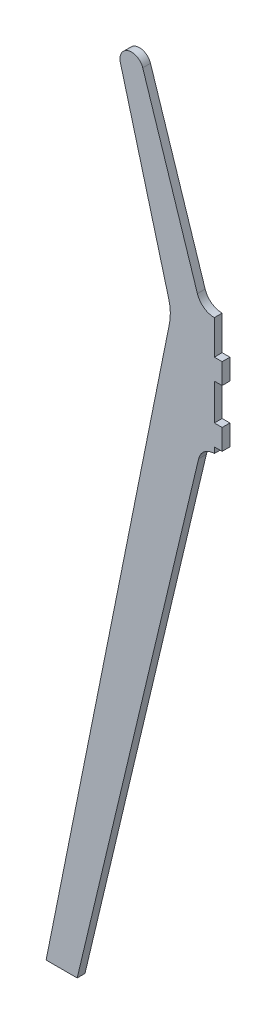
ISO-10303-21;
HEADER;
FILE_DESCRIPTION(('STEP AP214'),'2;1');
FILE_NAME('part.step','',(''),(''),'','','');
FILE_SCHEMA(('AUTOMOTIVE_DESIGN { 1 0 10303 214 1 1 1 1 }'));
ENDSEC;
DATA;
#1=APPLICATION_CONTEXT('core data for automotive mechanical design processes');
#2=APPLICATION_PROTOCOL_DEFINITION('international standard','automotive_design',2000,#1);
#3=PRODUCT_CONTEXT('',#1,'mechanical');
#4=PRODUCT('Part','Part','',(#3));
#5=PRODUCT_RELATED_PRODUCT_CATEGORY('part','',(#4));
#6=PRODUCT_DEFINITION_FORMATION('','',#4);
#7=PRODUCT_DEFINITION_CONTEXT('part definition',#1,'design');
#8=PRODUCT_DEFINITION('design','',#6,#7);
#9=PRODUCT_DEFINITION_SHAPE('','',#8);
#10=(LENGTH_UNIT() NAMED_UNIT(*) SI_UNIT(.MILLI.,.METRE.));
#11=(NAMED_UNIT(*) PLANE_ANGLE_UNIT() SI_UNIT($,.RADIAN.));
#12=(NAMED_UNIT(*) SI_UNIT($,.STERADIAN.) SOLID_ANGLE_UNIT());
#13=UNCERTAINTY_MEASURE_WITH_UNIT(LENGTH_MEASURE(1.E-05),#10,'distance_accuracy_value','');
#14=(GEOMETRIC_REPRESENTATION_CONTEXT(3) GLOBAL_UNCERTAINTY_ASSIGNED_CONTEXT((#13)) GLOBAL_UNIT_ASSIGNED_CONTEXT((#10,
#11,#12)) REPRESENTATION_CONTEXT('',''));
#15=CARTESIAN_POINT('',(0.,0.,0.));
#16=DIRECTION('',(0.,0.,1.));
#17=DIRECTION('',(1.,0.,0.));
#18=AXIS2_PLACEMENT_3D('',#15,#16,#17);
#19=CARTESIAN_POINT('',(-332.179186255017,-1195.84507051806,7.5));
#20=DIRECTION('',(0.980338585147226,-0.197322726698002,0.));
#21=DIRECTION('',(0.197322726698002,0.980338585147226,0.));
#22=AXIS2_PLACEMENT_3D('',#19,#20,#21);
#23=PLANE('',#22);
#24=DIRECTION('',(-0.197322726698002,-0.980338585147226,0.));
#25=VECTOR('',#24,1.);
#26=CARTESIAN_POINT('',(-332.179186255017,-1195.84507051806,-7.5));
#27=LINE('',#26,#25);
#28=CARTESIAN_POINT('',(-94.2175143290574,-13.604115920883,-7.5));
#29=VERTEX_POINT('',#28);
#30=CARTESIAN_POINT('',(-332.179186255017,-1195.84507051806,-7.5));
#31=VERTEX_POINT('',#30);
#32=EDGE_CURVE('E204',#29,#31,#27,.T.);
#33=ORIENTED_EDGE('',*,*,#32,.T.);
#34=DIRECTION('',(0.,0.,-1.));
#35=VECTOR('',#34,1.);
#36=CARTESIAN_POINT('',(-332.179186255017,-1195.84507051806,7.5));
#37=LINE('',#36,#35);
#38=CARTESIAN_POINT('',(-332.179186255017,-1195.84507051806,7.5));
#39=VERTEX_POINT('',#38);
#40=EDGE_CURVE('E11',#39,#31,#37,.T.);
#41=ORIENTED_EDGE('',*,*,#40,.F.);
#42=DIRECTION('',(-0.197322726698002,-0.980338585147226,0.));
#43=VECTOR('',#42,1.);
#44=CARTESIAN_POINT('',(-332.179186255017,-1195.84507051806,7.5));
#45=LINE('',#44,#43);
#46=CARTESIAN_POINT('',(-94.2175143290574,-13.604115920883,7.5));
#47=VERTEX_POINT('',#46);
#48=EDGE_CURVE('E256',#47,#39,#45,.T.);
#49=ORIENTED_EDGE('',*,*,#48,.F.);
#50=DIRECTION('',(0.,0.,-1.));
#51=VECTOR('',#50,1.);
#52=CARTESIAN_POINT('',(-94.2175143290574,-13.604115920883,7.5));
#53=LINE('',#52,#51);
#54=EDGE_CURVE('E200',#47,#29,#53,.T.);
#55=ORIENTED_EDGE('',*,*,#54,.T.);
#56=EDGE_LOOP('',(#33,#41,#49,#55));
#57=FACE_BOUND('',#56,.T.);
#58=ADVANCED_FACE('F43',(#57),#23,.F.);
#59=CARTESIAN_POINT('',(-332.179186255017,-1195.84507051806,7.5));
#60=DIRECTION('',(0.,1.,0.));
#61=DIRECTION('',(0.,0.,1.));
#62=AXIS2_PLACEMENT_3D('',#59,#60,#61);
#63=PLANE('',#62);
#64=DIRECTION('',(1.,0.,0.));
#65=VECTOR('',#64,1.);
#66=CARTESIAN_POINT('',(-332.179186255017,-1195.84507051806,-7.5));
#67=LINE('',#66,#65);
#68=CARTESIAN_POINT('',(-272.179186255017,-1195.84507051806,-7.5));
#69=VERTEX_POINT('',#68);
#70=EDGE_CURVE('E208',#31,#69,#67,.T.);
#71=ORIENTED_EDGE('',*,*,#70,.T.);
#72=DIRECTION('',(0.,0.,-1.));
#73=VECTOR('',#72,1.);
#74=CARTESIAN_POINT('',(-272.179186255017,-1195.84507051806,7.5));
#75=LINE('',#74,#73);
#76=CARTESIAN_POINT('',(-272.179186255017,-1195.84507051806,7.5));
#77=VERTEX_POINT('',#76);
#78=EDGE_CURVE('E52',#77,#69,#75,.T.);
#79=ORIENTED_EDGE('',*,*,#78,.F.);
#80=DIRECTION('',(1.,0.,0.));
#81=VECTOR('',#80,1.);
#82=CARTESIAN_POINT('',(-332.179186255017,-1195.84507051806,7.5));
#83=LINE('',#82,#81);
#84=EDGE_CURVE('E133',#39,#77,#83,.T.);
#85=ORIENTED_EDGE('',*,*,#84,.F.);
#86=ORIENTED_EDGE('',*,*,#40,.T.);
#87=EDGE_LOOP('',(#71,#79,#85,#86));
#88=FACE_BOUND('',#87,.T.);
#89=ADVANCED_FACE('F392',(#88),#63,.F.);
#90=CARTESIAN_POINT('',(-272.179186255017,-1195.84507051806,7.5));
#91=DIRECTION('',(-0.972854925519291,0.23141584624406,0.));
#92=DIRECTION('',(-0.23141584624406,-0.972854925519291,0.));
#93=AXIS2_PLACEMENT_3D('',#90,#91,#92);
#94=PLANE('',#93);
#95=DIRECTION('',(0.23141584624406,0.972854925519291,0.));
#96=VECTOR('',#95,1.);
#97=CARTESIAN_POINT('',(-272.179186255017,-1195.84507051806,-7.5));
#98=LINE('',#97,#96);
#99=CARTESIAN_POINT('',(-37.9099826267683,-210.994843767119,-7.5));
#100=VERTEX_POINT('',#99);
#101=EDGE_CURVE('E211',#69,#100,#98,.T.);
#102=ORIENTED_EDGE('',*,*,#101,.T.);
#103=DIRECTION('',(0.,0.,-1.));
#104=VECTOR('',#103,1.);
#105=CARTESIAN_POINT('',(-37.9099826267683,-210.994843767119,7.5));
#106=LINE('',#105,#104);
#107=CARTESIAN_POINT('',(-37.9099826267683,-210.994843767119,7.5));
#108=VERTEX_POINT('',#107);
#109=EDGE_CURVE('E307',#108,#100,#106,.T.);
#110=ORIENTED_EDGE('',*,*,#109,.F.);
#111=DIRECTION('',(0.23141584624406,0.972854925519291,0.));
#112=VECTOR('',#111,1.);
#113=CARTESIAN_POINT('',(-272.179186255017,-1195.84507051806,7.5));
#114=LINE('',#113,#112);
#115=EDGE_CURVE('E317',#77,#108,#114,.T.);
#116=ORIENTED_EDGE('',*,*,#115,.F.);
#117=ORIENTED_EDGE('',*,*,#78,.T.);
#118=EDGE_LOOP('',(#102,#110,#116,#117));
#119=FACE_BOUND('',#118,.T.);
#120=ADVANCED_FACE('F315',(#119),#94,.F.);
#121=CARTESIAN_POINT('',(-7.5,-218.228555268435,7.5));
#122=DIRECTION('',(0.,0.,-1.));
#123=DIRECTION('',(-1.,0.,0.));
#124=AXIS2_PLACEMENT_3D('',#121,#122,#123);
#125=CYLINDRICAL_SURFACE('',#124,31.2584968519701);
#126=CARTESIAN_POINT('',(-7.5,-218.228555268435,-7.5));
#127=DIRECTION('',(0.,0.,-1.));
#128=DIRECTION('',(-1.,0.,0.));
#129=AXIS2_PLACEMENT_3D('',#126,#127,#128);
#130=CIRCLE('',#129,31.2584968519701);
#131=CARTESIAN_POINT('',(-7.5,-186.970058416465,-7.5));
#132=VERTEX_POINT('',#131);
#133=EDGE_CURVE('E214',#100,#132,#130,.T.);
#134=ORIENTED_EDGE('',*,*,#133,.T.);
#135=DIRECTION('',(0.,0.,-1.));
#136=VECTOR('',#135,1.);
#137=CARTESIAN_POINT('',(-7.5,-186.970058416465,7.5));
#138=LINE('',#137,#136);
#139=CARTESIAN_POINT('',(-7.5,-186.970058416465,7.5));
#140=VERTEX_POINT('',#139);
#141=EDGE_CURVE('E303',#140,#132,#138,.T.);
#142=ORIENTED_EDGE('',*,*,#141,.F.);
#143=CARTESIAN_POINT('',(-7.5,-218.228555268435,7.5));
#144=DIRECTION('',(0.,0.,-1.));
#145=DIRECTION('',(-1.,0.,0.));
#146=AXIS2_PLACEMENT_3D('',#143,#144,#145);
#147=CIRCLE('',#146,31.2584968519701);
#148=EDGE_CURVE('E336',#108,#140,#147,.T.);
#149=ORIENTED_EDGE('',*,*,#148,.F.);
#150=ORIENTED_EDGE('',*,*,#109,.T.);
#151=EDGE_LOOP('',(#134,#142,#149,#150));
#152=FACE_BOUND('',#151,.T.);
#153=ADVANCED_FACE('F326',(#152),#125,.F.);
#154=CARTESIAN_POINT('',(-7.5,-186.970058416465,7.5));
#155=DIRECTION('',(-1.,0.,0.));
#156=DIRECTION('',(0.,0.,1.));
#157=AXIS2_PLACEMENT_3D('',#154,#155,#156);
#158=PLANE('',#157);
#159=DIRECTION('',(0.,1.,0.));
#160=VECTOR('',#159,1.);
#161=CARTESIAN_POINT('',(-7.5,-186.970058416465,-7.5));
#162=LINE('',#161,#160);
#163=CARTESIAN_POINT('',(-7.5,-175.900058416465,-7.5));
#164=VERTEX_POINT('',#163);
#165=EDGE_CURVE('E217',#132,#164,#162,.T.);
#166=ORIENTED_EDGE('',*,*,#165,.T.);
#167=DIRECTION('',(0.,0.,-1.));
#168=VECTOR('',#167,1.);
#169=CARTESIAN_POINT('',(-7.5,-175.900058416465,7.5));
#170=LINE('',#169,#168);
#171=CARTESIAN_POINT('',(-7.5,-175.900058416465,7.5));
#172=VERTEX_POINT('',#171);
#173=EDGE_CURVE('E299',#172,#164,#170,.T.);
#174=ORIENTED_EDGE('',*,*,#173,.F.);
#175=DIRECTION('',(0.,1.,0.));
#176=VECTOR('',#175,1.);
#177=CARTESIAN_POINT('',(-7.5,-186.970058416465,7.5));
#178=LINE('',#177,#176);
#179=EDGE_CURVE('E332',#140,#172,#178,.T.);
#180=ORIENTED_EDGE('',*,*,#179,.F.);
#181=ORIENTED_EDGE('',*,*,#141,.T.);
#182=EDGE_LOOP('',(#166,#174,#180,#181));
#183=FACE_BOUND('',#182,.T.);
#184=ADVANCED_FACE('F330',(#183),#158,.F.);
#185=CARTESIAN_POINT('',(-7.5,-175.900058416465,7.5));
#186=DIRECTION('',(0.,1.,0.));
#187=DIRECTION('',(0.,0.,1.));
#188=AXIS2_PLACEMENT_3D('',#185,#186,#187);
#189=PLANE('',#188);
#190=DIRECTION('',(1.,0.,0.));
#191=VECTOR('',#190,1.);
#192=CARTESIAN_POINT('',(-7.5,-175.900058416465,-7.5));
#193=LINE('',#192,#191);
#194=CARTESIAN_POINT('',(7.5,-175.900058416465,-7.5));
#195=VERTEX_POINT('',#194);
#196=EDGE_CURVE('E220',#164,#195,#193,.T.);
#197=ORIENTED_EDGE('',*,*,#196,.T.);
#198=DIRECTION('',(0.,0.,-1.));
#199=VECTOR('',#198,1.);
#200=CARTESIAN_POINT('',(7.5,-175.900058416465,7.5));
#201=LINE('',#200,#199);
#202=CARTESIAN_POINT('',(7.5,-175.900058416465,7.5));
#203=VERTEX_POINT('',#202);
#204=EDGE_CURVE('E295',#203,#195,#201,.T.);
#205=ORIENTED_EDGE('',*,*,#204,.F.);
#206=DIRECTION('',(1.,0.,0.));
#207=VECTOR('',#206,1.);
#208=CARTESIAN_POINT('',(-7.5,-175.900058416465,7.5));
#209=LINE('',#208,#207);
#210=EDGE_CURVE('E335',#172,#203,#209,.T.);
#211=ORIENTED_EDGE('',*,*,#210,.F.);
#212=ORIENTED_EDGE('',*,*,#173,.T.);
#213=EDGE_LOOP('',(#197,#205,#211,#212));
#214=FACE_BOUND('',#213,.T.);
#215=ADVANCED_FACE('F405',(#214),#189,.F.);
#216=CARTESIAN_POINT('',(7.5,-175.900058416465,7.5));
#217=DIRECTION('',(-1.,0.,0.));
#218=DIRECTION('',(0.,0.,1.));
#219=AXIS2_PLACEMENT_3D('',#216,#217,#218);
#220=PLANE('',#219);
#221=DIRECTION('',(0.,1.,0.));
#222=VECTOR('',#221,1.);
#223=CARTESIAN_POINT('',(7.5,-175.900058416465,-7.5));
#224=LINE('',#223,#222);
#225=CARTESIAN_POINT('',(7.5,-135.900058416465,-7.5));
#226=VERTEX_POINT('',#225);
#227=EDGE_CURVE('E223',#195,#226,#224,.T.);
#228=ORIENTED_EDGE('',*,*,#227,.T.);
#229=DIRECTION('',(0.,0.,-1.));
#230=VECTOR('',#229,1.);
#231=CARTESIAN_POINT('',(7.5,-135.900058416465,7.5));
#232=LINE('',#231,#230);
#233=CARTESIAN_POINT('',(7.5,-135.900058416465,7.5));
#234=VERTEX_POINT('',#233);
#235=EDGE_CURVE('E291',#234,#226,#232,.T.);
#236=ORIENTED_EDGE('',*,*,#235,.F.);
#237=DIRECTION('',(0.,1.,0.));
#238=VECTOR('',#237,1.);
#239=CARTESIAN_POINT('',(7.5,-175.900058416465,7.5));
#240=LINE('',#239,#238);
#241=EDGE_CURVE('E340',#203,#234,#240,.T.);
#242=ORIENTED_EDGE('',*,*,#241,.F.);
#243=ORIENTED_EDGE('',*,*,#204,.T.);
#244=EDGE_LOOP('',(#228,#236,#242,#243));
#245=FACE_BOUND('',#244,.T.);
#246=ADVANCED_FACE('F408',(#245),#220,.F.);
#247=CARTESIAN_POINT('',(7.5,-135.900058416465,7.5));
#248=DIRECTION('',(0.,-1.,0.));
#249=DIRECTION('',(0.,0.,-1.));
#250=AXIS2_PLACEMENT_3D('',#247,#248,#249);
#251=PLANE('',#250);
#252=DIRECTION('',(-1.,0.,0.));
#253=VECTOR('',#252,1.);
#254=CARTESIAN_POINT('',(7.5,-135.900058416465,-7.5));
#255=LINE('',#254,#253);
#256=CARTESIAN_POINT('',(-7.5,-135.900058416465,-7.5));
#257=VERTEX_POINT('',#256);
#258=EDGE_CURVE('E226',#226,#257,#255,.T.);
#259=ORIENTED_EDGE('',*,*,#258,.T.);
#260=DIRECTION('',(0.,0.,-1.));
#261=VECTOR('',#260,1.);
#262=CARTESIAN_POINT('',(-7.5,-135.900058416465,7.5));
#263=LINE('',#262,#261);
#264=CARTESIAN_POINT('',(-7.5,-135.900058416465,7.5));
#265=VERTEX_POINT('',#264);
#266=EDGE_CURVE('E287',#265,#257,#263,.T.);
#267=ORIENTED_EDGE('',*,*,#266,.F.);
#268=DIRECTION('',(-1.,0.,0.));
#269=VECTOR('',#268,1.);
#270=CARTESIAN_POINT('',(7.5,-135.900058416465,7.5));
#271=LINE('',#270,#269);
#272=EDGE_CURVE('E347',#234,#265,#271,.T.);
#273=ORIENTED_EDGE('',*,*,#272,.F.);
#274=ORIENTED_EDGE('',*,*,#235,.T.);
#275=EDGE_LOOP('',(#259,#267,#273,#274));
#276=FACE_BOUND('',#275,.T.);
#277=ADVANCED_FACE('F412',(#276),#251,.F.);
#278=CARTESIAN_POINT('',(-7.5,-135.900058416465,7.5));
#279=DIRECTION('',(-1.,0.,0.));
#280=DIRECTION('',(0.,0.,1.));
#281=AXIS2_PLACEMENT_3D('',#278,#279,#280);
#282=PLANE('',#281);
#283=DIRECTION('',(0.,1.,0.));
#284=VECTOR('',#283,1.);
#285=CARTESIAN_POINT('',(-7.5,-135.900058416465,-7.5));
#286=LINE('',#285,#284);
#287=CARTESIAN_POINT('',(-7.5,-65.9000584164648,-7.5));
#288=VERTEX_POINT('',#287);
#289=EDGE_CURVE('E229',#257,#288,#286,.T.);
#290=ORIENTED_EDGE('',*,*,#289,.T.);
#291=DIRECTION('',(0.,0.,-1.));
#292=VECTOR('',#291,1.);
#293=CARTESIAN_POINT('',(-7.5,-65.9000584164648,7.5));
#294=LINE('',#293,#292);
#295=CARTESIAN_POINT('',(-7.5,-65.9000584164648,7.5));
#296=VERTEX_POINT('',#295);
#297=EDGE_CURVE('E283',#296,#288,#294,.T.);
#298=ORIENTED_EDGE('',*,*,#297,.F.);
#299=DIRECTION('',(0.,1.,0.));
#300=VECTOR('',#299,1.);
#301=CARTESIAN_POINT('',(-7.5,-135.900058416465,7.5));
#302=LINE('',#301,#300);
#303=EDGE_CURVE('E350',#265,#296,#302,.T.);
#304=ORIENTED_EDGE('',*,*,#303,.F.);
#305=ORIENTED_EDGE('',*,*,#266,.T.);
#306=EDGE_LOOP('',(#290,#298,#304,#305));
#307=FACE_BOUND('',#306,.T.);
#308=ADVANCED_FACE('F416',(#307),#282,.F.);
#309=CARTESIAN_POINT('',(-7.5,-65.9000584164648,7.5));
#310=DIRECTION('',(0.,1.,0.));
#311=DIRECTION('',(0.,0.,1.));
#312=AXIS2_PLACEMENT_3D('',#309,#310,#311);
#313=PLANE('',#312);
#314=DIRECTION('',(1.,0.,0.));
#315=VECTOR('',#314,1.);
#316=CARTESIAN_POINT('',(-7.5,-65.9000584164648,-7.5));
#317=LINE('',#316,#315);
#318=CARTESIAN_POINT('',(7.5,-65.9000584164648,-7.5));
#319=VERTEX_POINT('',#318);
#320=EDGE_CURVE('E232',#288,#319,#317,.T.);
#321=ORIENTED_EDGE('',*,*,#320,.T.);
#322=DIRECTION('',(0.,0.,-1.));
#323=VECTOR('',#322,1.);
#324=CARTESIAN_POINT('',(7.5,-65.9000584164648,7.5));
#325=LINE('',#324,#323);
#326=CARTESIAN_POINT('',(7.5,-65.9000584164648,7.5));
#327=VERTEX_POINT('',#326);
#328=EDGE_CURVE('E279',#327,#319,#325,.T.);
#329=ORIENTED_EDGE('',*,*,#328,.F.);
#330=DIRECTION('',(1.,0.,0.));
#331=VECTOR('',#330,1.);
#332=CARTESIAN_POINT('',(-7.5,-65.9000584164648,7.5));
#333=LINE('',#332,#331);
#334=EDGE_CURVE('E353',#296,#327,#333,.T.);
#335=ORIENTED_EDGE('',*,*,#334,.F.);
#336=ORIENTED_EDGE('',*,*,#297,.T.);
#337=EDGE_LOOP('',(#321,#329,#335,#336));
#338=FACE_BOUND('',#337,.T.);
#339=ADVANCED_FACE('F420',(#338),#313,.F.);
#340=CARTESIAN_POINT('',(7.5,-65.9000584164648,7.5));
#341=DIRECTION('',(-1.,0.,0.));
#342=DIRECTION('',(0.,-1.,0.));
#343=AXIS2_PLACEMENT_3D('',#340,#341,#342);
#344=PLANE('',#343);
#345=DIRECTION('',(0.,1.,0.));
#346=VECTOR('',#345,1.);
#347=CARTESIAN_POINT('',(7.5,-65.9000584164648,-7.5));
#348=LINE('',#347,#346);
#349=CARTESIAN_POINT('',(7.5,-25.9000584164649,-7.5));
#350=VERTEX_POINT('',#349);
#351=EDGE_CURVE('E235',#319,#350,#348,.T.);
#352=ORIENTED_EDGE('',*,*,#351,.T.);
#353=DIRECTION('',(0.,0.,-1.));
#354=VECTOR('',#353,1.);
#355=CARTESIAN_POINT('',(7.5,-25.9000584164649,7.5));
#356=LINE('',#355,#354);
#357=CARTESIAN_POINT('',(7.5,-25.9000584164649,7.5));
#358=VERTEX_POINT('',#357);
#359=EDGE_CURVE('E275',#358,#350,#356,.T.);
#360=ORIENTED_EDGE('',*,*,#359,.F.);
#361=DIRECTION('',(0.,1.,0.));
#362=VECTOR('',#361,1.);
#363=CARTESIAN_POINT('',(7.5,-65.9000584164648,7.5));
#364=LINE('',#363,#362);
#365=EDGE_CURVE('E356',#327,#358,#364,.T.);
#366=ORIENTED_EDGE('',*,*,#365,.F.);
#367=ORIENTED_EDGE('',*,*,#328,.T.);
#368=EDGE_LOOP('',(#352,#360,#366,#367));
#369=FACE_BOUND('',#368,.T.);
#370=ADVANCED_FACE('F424',(#369),#344,.F.);
#371=CARTESIAN_POINT('',(7.5,-25.9000584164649,7.5));
#372=DIRECTION('',(0.,-1.,0.));
#373=DIRECTION('',(0.,0.,-1.));
#374=AXIS2_PLACEMENT_3D('',#371,#372,#373);
#375=PLANE('',#374);
#376=DIRECTION('',(-1.,0.,0.));
#377=VECTOR('',#376,1.);
#378=CARTESIAN_POINT('',(7.5,-25.9000584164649,-7.5));
#379=LINE('',#378,#377);
#380=CARTESIAN_POINT('',(-7.5,-25.9000584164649,-7.5));
#381=VERTEX_POINT('',#380);
#382=EDGE_CURVE('E238',#350,#381,#379,.T.);
#383=ORIENTED_EDGE('',*,*,#382,.T.);
#384=DIRECTION('',(0.,0.,-1.));
#385=VECTOR('',#384,1.);
#386=CARTESIAN_POINT('',(-7.5,-25.9000584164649,7.5));
#387=LINE('',#386,#385);
#388=CARTESIAN_POINT('',(-7.5,-25.9000584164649,7.5));
#389=VERTEX_POINT('',#388);
#390=EDGE_CURVE('E271',#389,#381,#387,.T.);
#391=ORIENTED_EDGE('',*,*,#390,.F.);
#392=DIRECTION('',(-1.,0.,0.));
#393=VECTOR('',#392,1.);
#394=CARTESIAN_POINT('',(7.5,-25.9000584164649,7.5));
#395=LINE('',#394,#393);
#396=EDGE_CURVE('E359',#358,#389,#395,.T.);
#397=ORIENTED_EDGE('',*,*,#396,.F.);
#398=ORIENTED_EDGE('',*,*,#359,.T.);
#399=EDGE_LOOP('',(#383,#391,#397,#398));
#400=FACE_BOUND('',#399,.T.);
#401=ADVANCED_FACE('F428',(#400),#375,.F.);
#402=CARTESIAN_POINT('',(-7.5,-25.9000584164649,7.5));
#403=DIRECTION('',(-1.,0.,0.));
#404=DIRECTION('',(0.,-1.,0.));
#405=AXIS2_PLACEMENT_3D('',#402,#403,#404);
#406=PLANE('',#405);
#407=DIRECTION('',(0.,1.,0.));
#408=VECTOR('',#407,1.);
#409=CARTESIAN_POINT('',(-7.5,-25.9000584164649,-7.5));
#410=LINE('',#409,#408);
#411=CARTESIAN_POINT('',(-7.5,40.1699415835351,-7.5));
#412=VERTEX_POINT('',#411);
#413=EDGE_CURVE('E241',#381,#412,#410,.T.);
#414=ORIENTED_EDGE('',*,*,#413,.T.);
#415=DIRECTION('',(0.,0.,-1.));
#416=VECTOR('',#415,1.);
#417=CARTESIAN_POINT('',(-7.5,40.1699415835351,7.5));
#418=LINE('',#417,#416);
#419=CARTESIAN_POINT('',(-7.5,40.1699415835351,7.5));
#420=VERTEX_POINT('',#419);
#421=EDGE_CURVE('E267',#420,#412,#418,.T.);
#422=ORIENTED_EDGE('',*,*,#421,.F.);
#423=DIRECTION('',(0.,1.,0.));
#424=VECTOR('',#423,1.);
#425=CARTESIAN_POINT('',(-7.5,-25.9000584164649,7.5));
#426=LINE('',#425,#424);
#427=EDGE_CURVE('E362',#389,#420,#426,.T.);
#428=ORIENTED_EDGE('',*,*,#427,.F.);
#429=ORIENTED_EDGE('',*,*,#390,.T.);
#430=EDGE_LOOP('',(#414,#422,#428,#429));
#431=FACE_BOUND('',#430,.T.);
#432=ADVANCED_FACE('F432',(#431),#406,.F.);
#433=CARTESIAN_POINT('',(-7.5,74.581530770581,7.5));
#434=DIRECTION('',(0.,0.,-1.));
#435=DIRECTION('',(-1.,0.,0.));
#436=AXIS2_PLACEMENT_3D('',#433,#434,#435);
#437=CYLINDRICAL_SURFACE('',#436,34.4115891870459);
#438=CARTESIAN_POINT('',(-7.5,74.581530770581,-7.5));
#439=DIRECTION('',(0.,0.,-1.));
#440=DIRECTION('',(1.,0.,0.));
#441=AXIS2_PLACEMENT_3D('',#438,#439,#440);
#442=CIRCLE('',#441,34.4115891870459);
#443=CARTESIAN_POINT('',(-40.2273661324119,63.9477649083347,-7.5));
#444=VERTEX_POINT('',#443);
#445=EDGE_CURVE('E244',#412,#444,#442,.T.);
#446=ORIENTED_EDGE('',*,*,#445,.T.);
#447=DIRECTION('',(0.,0.,-1.));
#448=VECTOR('',#447,1.);
#449=CARTESIAN_POINT('',(-40.2273661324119,63.9477649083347,7.5));
#450=LINE('',#449,#448);
#451=CARTESIAN_POINT('',(-40.2273661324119,63.9477649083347,7.5));
#452=VERTEX_POINT('',#451);
#453=EDGE_CURVE('E263',#452,#444,#450,.T.);
#454=ORIENTED_EDGE('',*,*,#453,.F.);
#455=CARTESIAN_POINT('',(-7.5,74.581530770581,7.5));
#456=DIRECTION('',(0.,0.,-1.));
#457=DIRECTION('',(1.,0.,0.));
#458=AXIS2_PLACEMENT_3D('',#455,#456,#457);
#459=CIRCLE('',#458,34.4115891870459);
#460=EDGE_CURVE('E365',#420,#452,#459,.T.);
#461=ORIENTED_EDGE('',*,*,#460,.F.);
#462=ORIENTED_EDGE('',*,*,#421,.T.);
#463=EDGE_LOOP('',(#446,#454,#461,#462));
#464=FACE_BOUND('',#463,.T.);
#465=ADVANCED_FACE('F373',(#464),#437,.F.);
#466=CARTESIAN_POINT('',(-145.714078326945,388.602482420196,7.5));
#467=DIRECTION('',(-0.951056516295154,-0.309016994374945,0.));
#468=DIRECTION('',(0.309016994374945,-0.951056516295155,0.));
#469=AXIS2_PLACEMENT_3D('',#466,#467,#468);
#470=PLANE('',#469);
#471=DIRECTION('',(-0.309016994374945,0.951056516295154,0.));
#472=VECTOR('',#471,1.);
#473=CARTESIAN_POINT('',(-145.714078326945,388.602482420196,-7.5));
#474=LINE('',#473,#472);
#475=CARTESIAN_POINT('',(-145.714078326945,388.602482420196,-7.5));
#476=VERTEX_POINT('',#475);
#477=EDGE_CURVE('E247',#444,#476,#474,.T.);
#478=ORIENTED_EDGE('',*,*,#477,.T.);
#479=DIRECTION('',(0.,0.,-1.));
#480=VECTOR('',#479,1.);
#481=CARTESIAN_POINT('',(-145.714078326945,388.602482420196,7.5));
#482=LINE('',#481,#480);
#483=CARTESIAN_POINT('',(-145.714078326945,388.602482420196,7.5));
#484=VERTEX_POINT('',#483);
#485=EDGE_CURVE('E193',#484,#476,#482,.T.);
#486=ORIENTED_EDGE('',*,*,#485,.F.);
#487=DIRECTION('',(-0.309016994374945,0.951056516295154,0.));
#488=VECTOR('',#487,1.);
#489=CARTESIAN_POINT('',(-145.714078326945,388.602482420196,7.5));
#490=LINE('',#489,#488);
#491=EDGE_CURVE('E182',#452,#484,#490,.T.);
#492=ORIENTED_EDGE('',*,*,#491,.F.);
#493=ORIENTED_EDGE('',*,*,#453,.T.);
#494=EDGE_LOOP('',(#478,#486,#492,#493));
#495=FACE_BOUND('',#494,.T.);
#496=ADVANCED_FACE('F377',(#495),#470,.F.);
#497=CARTESIAN_POINT('',(-167.12018528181,381.647216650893,7.5));
#498=DIRECTION('',(0.,0.,-1.));
#499=DIRECTION('',(-1.,0.,0.));
#500=AXIS2_PLACEMENT_3D('',#497,#498,#499);
#501=CYLINDRICAL_SURFACE('',#500,22.5077128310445);
#502=CARTESIAN_POINT('',(-167.12018528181,381.647216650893,-7.5));
#503=DIRECTION('',(0.,0.,1.));
#504=DIRECTION('',(-1.,0.,0.));
#505=AXIS2_PLACEMENT_3D('',#502,#503,#504);
#506=CIRCLE('',#505,22.5077128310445);
#507=CARTESIAN_POINT('',(-188.860966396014,375.82179190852,-7.5));
#508=VERTEX_POINT('',#507);
#509=EDGE_CURVE('E191',#476,#508,#506,.T.);
#510=ORIENTED_EDGE('',*,*,#509,.T.);
#511=DIRECTION('',(0.,0.,-1.));
#512=VECTOR('',#511,1.);
#513=CARTESIAN_POINT('',(-188.860966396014,375.82179190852,7.5));
#514=LINE('',#513,#512);
#515=CARTESIAN_POINT('',(-188.860966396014,375.82179190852,7.5));
#516=VERTEX_POINT('',#515);
#517=EDGE_CURVE('E188',#516,#508,#514,.T.);
#518=ORIENTED_EDGE('',*,*,#517,.F.);
#519=CARTESIAN_POINT('',(-167.12018528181,381.647216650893,7.5));
#520=DIRECTION('',(0.,0.,1.));
#521=DIRECTION('',(-1.,0.,0.));
#522=AXIS2_PLACEMENT_3D('',#519,#520,#521);
#523=CIRCLE('',#522,22.5077128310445);
#524=EDGE_CURVE('E176',#484,#516,#523,.T.);
#525=ORIENTED_EDGE('',*,*,#524,.F.);
#526=ORIENTED_EDGE('',*,*,#485,.T.);
#527=EDGE_LOOP('',(#510,#518,#525,#526));
#528=FACE_BOUND('',#527,.T.);
#529=ADVANCED_FACE('F189',(#528),#501,.T.);
#530=CARTESIAN_POINT('',(-95.5146626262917,27.4486435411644,7.5));
#531=DIRECTION('',(0.965925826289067,0.258819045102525,0.));
#532=DIRECTION('',(-0.258819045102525,0.965925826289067,0.));
#533=AXIS2_PLACEMENT_3D('',#530,#531,#532);
#534=PLANE('',#533);
#535=DIRECTION('',(0.258819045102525,-0.965925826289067,0.));
#536=VECTOR('',#535,1.);
#537=CARTESIAN_POINT('',(-95.5146626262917,27.4486435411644,-7.5));
#538=LINE('',#537,#536);
#539=CARTESIAN_POINT('',(-95.5146626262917,27.4486435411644,-7.5));
#540=VERTEX_POINT('',#539);
#541=EDGE_CURVE('E119',#508,#540,#538,.T.);
#542=ORIENTED_EDGE('',*,*,#541,.T.);
#543=DIRECTION('',(0.,0.,-1.));
#544=VECTOR('',#543,1.);
#545=CARTESIAN_POINT('',(-95.5146626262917,27.4486435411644,7.5));
#546=LINE('',#545,#544);
#547=CARTESIAN_POINT('',(-95.5146626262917,27.4486435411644,7.5));
#548=VERTEX_POINT('',#547);
#549=EDGE_CURVE('E194',#548,#540,#546,.T.);
#550=ORIENTED_EDGE('',*,*,#549,.F.);
#551=DIRECTION('',(0.258819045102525,-0.965925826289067,0.));
#552=VECTOR('',#551,1.);
#553=CARTESIAN_POINT('',(-95.5146626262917,27.4486435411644,7.5));
#554=LINE('',#553,#552);
#555=EDGE_CURVE('E180',#516,#548,#554,.T.);
#556=ORIENTED_EDGE('',*,*,#555,.F.);
#557=ORIENTED_EDGE('',*,*,#517,.T.);
#558=EDGE_LOOP('',(#542,#550,#556,#557));
#559=FACE_BOUND('',#558,.T.);
#560=ADVANCED_FACE('F196',(#559),#534,.F.);
#561=CARTESIAN_POINT('',(-182.447986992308,4.15492948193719,7.5));
#562=DIRECTION('',(0.,0.,-1.));
#563=DIRECTION('',(-1.,0.,0.));
#564=AXIS2_PLACEMENT_3D('',#561,#562,#563);
#565=CYLINDRICAL_SURFACE('',#564,90.);
#566=CARTESIAN_POINT('',(-182.447986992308,4.15492948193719,-7.5));
#567=DIRECTION('',(0.,0.,-1.));
#568=DIRECTION('',(1.,0.,0.));
#569=AXIS2_PLACEMENT_3D('',#566,#567,#568);
#570=CIRCLE('',#569,90.);
#571=EDGE_CURVE('E125',#540,#29,#570,.T.);
#572=ORIENTED_EDGE('',*,*,#571,.T.);
#573=ORIENTED_EDGE('',*,*,#54,.F.);
#574=CARTESIAN_POINT('',(-182.447986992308,4.15492948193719,7.5));
#575=DIRECTION('',(0.,0.,-1.));
#576=DIRECTION('',(1.,0.,0.));
#577=AXIS2_PLACEMENT_3D('',#574,#575,#576);
#578=CIRCLE('',#577,90.);
#579=EDGE_CURVE('E60',#548,#47,#578,.T.);
#580=ORIENTED_EDGE('',*,*,#579,.F.);
#581=ORIENTED_EDGE('',*,*,#549,.T.);
#582=EDGE_LOOP('',(#572,#573,#580,#581));
#583=FACE_BOUND('',#582,.T.);
#584=ADVANCED_FACE('F381',(#583),#565,.F.);
#585=CARTESIAN_POINT('',(-182.447986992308,4.15492948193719,7.5));
#586=DIRECTION('',(0.,0.,1.));
#587=DIRECTION('',(1.,0.,0.));
#588=AXIS2_PLACEMENT_3D('',#585,#586,#587);
#589=PLANE('',#588);
#590=ORIENTED_EDGE('',*,*,#48,.T.);
#591=ORIENTED_EDGE('',*,*,#84,.T.);
#592=ORIENTED_EDGE('',*,*,#115,.T.);
#593=ORIENTED_EDGE('',*,*,#148,.T.);
#594=ORIENTED_EDGE('',*,*,#179,.T.);
#595=ORIENTED_EDGE('',*,*,#210,.T.);
#596=ORIENTED_EDGE('',*,*,#241,.T.);
#597=ORIENTED_EDGE('',*,*,#272,.T.);
#598=ORIENTED_EDGE('',*,*,#303,.T.);
#599=ORIENTED_EDGE('',*,*,#334,.T.);
#600=ORIENTED_EDGE('',*,*,#365,.T.);
#601=ORIENTED_EDGE('',*,*,#396,.T.);
#602=ORIENTED_EDGE('',*,*,#427,.T.);
#603=ORIENTED_EDGE('',*,*,#460,.T.);
#604=ORIENTED_EDGE('',*,*,#491,.T.);
#605=ORIENTED_EDGE('',*,*,#524,.T.);
#606=ORIENTED_EDGE('',*,*,#555,.T.);
#607=ORIENTED_EDGE('',*,*,#579,.T.);
#608=EDGE_LOOP('',(#590,#591,#592,#593,#594,#595,#596,#597,#598,#599,#600,#601,#602,#603,#604,
#605,#606,#607));
#609=FACE_BOUND('',#608,.T.);
#610=ADVANCED_FACE('F178',(#609),#589,.T.);
#611=CARTESIAN_POINT('',(-182.447986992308,4.15492948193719,-7.5));
#612=DIRECTION('',(0.,0.,1.));
#613=DIRECTION('',(1.,0.,0.));
#614=AXIS2_PLACEMENT_3D('',#611,#612,#613);
#615=PLANE('',#614);
#616=ORIENTED_EDGE('',*,*,#32,.F.);
#617=ORIENTED_EDGE('',*,*,#571,.F.);
#618=ORIENTED_EDGE('',*,*,#541,.F.);
#619=ORIENTED_EDGE('',*,*,#509,.F.);
#620=ORIENTED_EDGE('',*,*,#477,.F.);
#621=ORIENTED_EDGE('',*,*,#445,.F.);
#622=ORIENTED_EDGE('',*,*,#413,.F.);
#623=ORIENTED_EDGE('',*,*,#382,.F.);
#624=ORIENTED_EDGE('',*,*,#351,.F.);
#625=ORIENTED_EDGE('',*,*,#320,.F.);
#626=ORIENTED_EDGE('',*,*,#289,.F.);
#627=ORIENTED_EDGE('',*,*,#258,.F.);
#628=ORIENTED_EDGE('',*,*,#227,.F.);
#629=ORIENTED_EDGE('',*,*,#196,.F.);
#630=ORIENTED_EDGE('',*,*,#165,.F.);
#631=ORIENTED_EDGE('',*,*,#133,.F.);
#632=ORIENTED_EDGE('',*,*,#101,.F.);
#633=ORIENTED_EDGE('',*,*,#70,.F.);
#634=EDGE_LOOP('',(#616,#617,#618,#619,#620,#621,#622,#623,#624,#625,#626,#627,#628,#629,#630,
#631,#632,#633));
#635=FACE_BOUND('',#634,.T.);
#636=ADVANCED_FACE('F321',(#635),#615,.F.);
#637=CLOSED_SHELL('',(#58,#89,#120,#153,#184,#215,#246,#277,#308,#339,#370,#401,#432,#465,#496,
#529,#560,#584,#610,#636));
#638=MANIFOLD_SOLID_BREP('B2',#637);
#639=ADVANCED_BREP_SHAPE_REPRESENTATION('',(#18,#638),#14);
#640=SHAPE_DEFINITION_REPRESENTATION(#9,#639);
ENDSEC;
END-ISO-10303-21;
